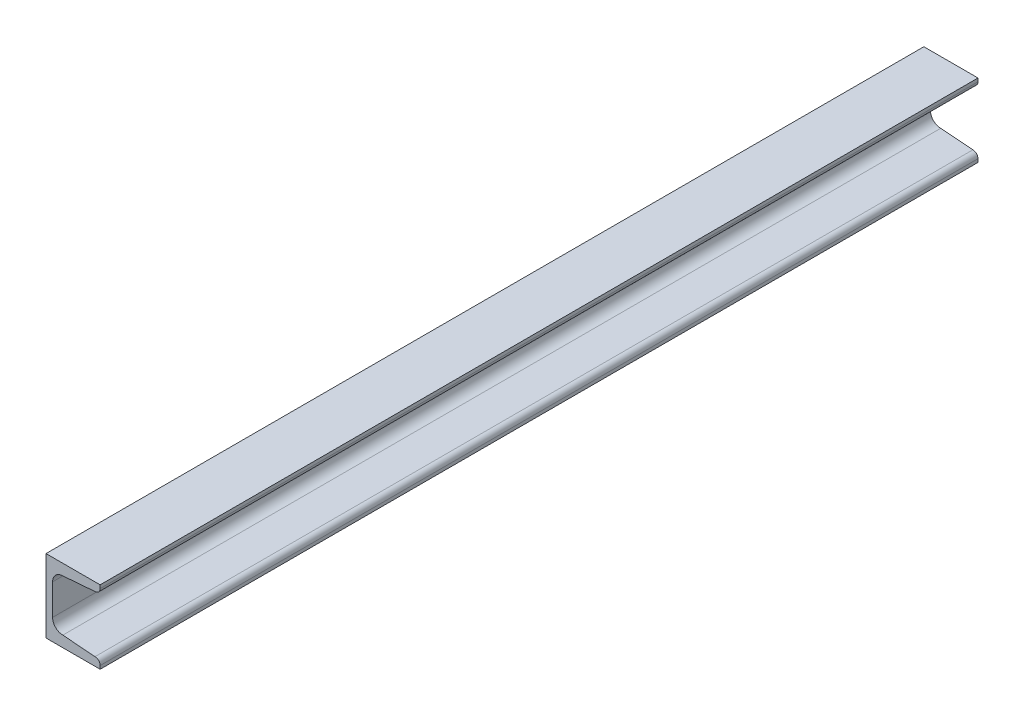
ISO-10303-21;
HEADER;
FILE_DESCRIPTION(('STEP AP214'),'2;1');
FILE_NAME('part.step','',(''),(''),'','','');
FILE_SCHEMA(('AUTOMOTIVE_DESIGN { 1 0 10303 214 1 1 1 1 }'));
ENDSEC;
DATA;
#1=APPLICATION_CONTEXT('core data for automotive mechanical design processes');
#2=APPLICATION_PROTOCOL_DEFINITION('international standard','automotive_design',2000,#1);
#3=PRODUCT_CONTEXT('',#1,'mechanical');
#4=PRODUCT('Part','Part','',(#3));
#5=PRODUCT_RELATED_PRODUCT_CATEGORY('part','',(#4));
#6=PRODUCT_DEFINITION_FORMATION('','',#4);
#7=PRODUCT_DEFINITION_CONTEXT('part definition',#1,'design');
#8=PRODUCT_DEFINITION('design','',#6,#7);
#9=PRODUCT_DEFINITION_SHAPE('','',#8);
#10=(LENGTH_UNIT() NAMED_UNIT(*) SI_UNIT(.MILLI.,.METRE.));
#11=(NAMED_UNIT(*) PLANE_ANGLE_UNIT() SI_UNIT($,.RADIAN.));
#12=(NAMED_UNIT(*) SI_UNIT($,.STERADIAN.) SOLID_ANGLE_UNIT());
#13=UNCERTAINTY_MEASURE_WITH_UNIT(LENGTH_MEASURE(1.E-05),#10,'distance_accuracy_value','');
#14=(GEOMETRIC_REPRESENTATION_CONTEXT(3) GLOBAL_UNCERTAINTY_ASSIGNED_CONTEXT((#13)) GLOBAL_UNIT_ASSIGNED_CONTEXT((#10,
#11,#12)) REPRESENTATION_CONTEXT('',''));
#15=CARTESIAN_POINT('',(0.,0.,0.));
#16=DIRECTION('',(0.,0.,1.));
#17=DIRECTION('',(1.,0.,0.));
#18=AXIS2_PLACEMENT_3D('',#15,#16,#17);
#19=CARTESIAN_POINT('',(4.5,-23.5226677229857,600.));
#20=DIRECTION('',(1.,0.,0.));
#21=DIRECTION('',(0.,0.,-1.));
#22=AXIS2_PLACEMENT_3D('',#19,#20,#21);
#23=PLANE('',#22);
#24=DIRECTION('',(0.,-1.,0.));
#25=VECTOR('',#24,1.);
#26=CARTESIAN_POINT('',(4.5,-23.5226677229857,0.));
#27=LINE('',#26,#25);
#28=CARTESIAN_POINT('',(4.5,35.525,0.));
#29=VERTEX_POINT('',#28);
#30=CARTESIAN_POINT('',(4.5,14.475,0.));
#31=VERTEX_POINT('',#30);
#32=EDGE_CURVE('E152',#29,#31,#27,.T.);
#33=ORIENTED_EDGE('',*,*,#32,.F.);
#34=DIRECTION('',(0.,0.,-1.));
#35=VECTOR('',#34,1.);
#36=CARTESIAN_POINT('',(4.5,35.525,600.));
#37=LINE('',#36,#35);
#38=CARTESIAN_POINT('',(4.5,35.525,600.));
#39=VERTEX_POINT('',#38);
#40=EDGE_CURVE('E11',#39,#29,#37,.T.);
#41=ORIENTED_EDGE('',*,*,#40,.F.);
#42=DIRECTION('',(0.,-1.,0.));
#43=VECTOR('',#42,1.);
#44=CARTESIAN_POINT('',(4.5,-23.5226677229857,600.));
#45=LINE('',#44,#43);
#46=CARTESIAN_POINT('',(4.5,14.475,600.));
#47=VERTEX_POINT('',#46);
#48=EDGE_CURVE('E181',#39,#47,#45,.T.);
#49=ORIENTED_EDGE('',*,*,#48,.T.);
#50=DIRECTION('',(0.,0.,-1.));
#51=VECTOR('',#50,1.);
#52=CARTESIAN_POINT('',(4.5,14.475,600.));
#53=LINE('',#52,#51);
#54=EDGE_CURVE('E50',#47,#31,#53,.T.);
#55=ORIENTED_EDGE('',*,*,#54,.T.);
#56=EDGE_LOOP('',(#33,#41,#49,#55));
#57=FACE_BOUND('',#56,.T.);
#58=ADVANCED_FACE('F34',(#57),#23,.T.);
#59=CARTESIAN_POINT('',(11.5,35.525,600.));
#60=DIRECTION('',(0.,0.,-1.));
#61=DIRECTION('',(-1.,0.,0.));
#62=AXIS2_PLACEMENT_3D('',#59,#60,#61);
#63=CYLINDRICAL_SURFACE('',#62,7.);
#64=CARTESIAN_POINT('',(11.5,35.525,0.));
#65=DIRECTION('',(0.,0.,1.));
#66=DIRECTION('',(1.,0.,0.));
#67=AXIS2_PLACEMENT_3D('',#64,#65,#66);
#68=CIRCLE('',#67,7.);
#69=CARTESIAN_POINT('',(11.5,42.525,0.));
#70=VERTEX_POINT('',#69);
#71=EDGE_CURVE('E154',#29,#70,#68,.F.);
#72=ORIENTED_EDGE('',*,*,#71,.T.);
#73=DIRECTION('',(0.,0.,-1.));
#74=VECTOR('',#73,1.);
#75=CARTESIAN_POINT('',(11.5,42.525,600.));
#76=LINE('',#75,#74);
#77=CARTESIAN_POINT('',(11.5,42.525,600.));
#78=VERTEX_POINT('',#77);
#79=EDGE_CURVE('E42',#78,#70,#76,.T.);
#80=ORIENTED_EDGE('',*,*,#79,.F.);
#81=CARTESIAN_POINT('',(11.5,35.525,600.));
#82=DIRECTION('',(0.,0.,1.));
#83=DIRECTION('',(1.,0.,0.));
#84=AXIS2_PLACEMENT_3D('',#81,#82,#83);
#85=CIRCLE('',#84,7.);
#86=EDGE_CURVE('E222',#39,#78,#85,.F.);
#87=ORIENTED_EDGE('',*,*,#86,.F.);
#88=ORIENTED_EDGE('',*,*,#40,.T.);
#89=EDGE_LOOP('',(#72,#80,#87,#88));
#90=FACE_BOUND('',#89,.T.);
#91=ADVANCED_FACE('F253',(#90),#63,.F.);
#92=CARTESIAN_POINT('',(13.2352286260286,42.6630295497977,600.));
#93=DIRECTION('',(-0.0792949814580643,0.996851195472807,0.));
#94=DIRECTION('',(-0.996851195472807,-0.0792949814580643,0.));
#95=AXIS2_PLACEMENT_3D('',#92,#93,#94);
#96=PLANE('',#95);
#97=DIRECTION('',(0.996851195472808,0.0792949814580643,0.));
#98=VECTOR('',#97,1.);
#99=CARTESIAN_POINT('',(13.2352286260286,42.6630295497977,0.));
#100=LINE('',#99,#98);
#101=CARTESIAN_POINT('',(33.5,44.275,0.));
#102=VERTEX_POINT('',#101);
#103=EDGE_CURVE('E156',#70,#102,#100,.T.);
#104=ORIENTED_EDGE('',*,*,#103,.T.);
#105=DIRECTION('',(0.,0.,-1.));
#106=VECTOR('',#105,1.);
#107=CARTESIAN_POINT('',(33.5,44.275,600.));
#108=LINE('',#107,#106);
#109=CARTESIAN_POINT('',(33.5,44.275,600.));
#110=VERTEX_POINT('',#109);
#111=EDGE_CURVE('E196',#110,#102,#108,.T.);
#112=ORIENTED_EDGE('',*,*,#111,.F.);
#113=DIRECTION('',(0.996851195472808,0.0792949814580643,0.));
#114=VECTOR('',#113,1.);
#115=CARTESIAN_POINT('',(13.2352286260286,42.6630295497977,600.));
#116=LINE('',#115,#114);
#117=EDGE_CURVE('E204',#78,#110,#116,.T.);
#118=ORIENTED_EDGE('',*,*,#117,.F.);
#119=ORIENTED_EDGE('',*,*,#79,.T.);
#120=EDGE_LOOP('',(#104,#112,#118,#119));
#121=FACE_BOUND('',#120,.T.);
#122=ADVANCED_FACE('F202',(#121),#96,.F.);
#123=CARTESIAN_POINT('',(33.5,47.775,600.));
#124=DIRECTION('',(0.,0.,-1.));
#125=DIRECTION('',(-1.,0.,0.));
#126=AXIS2_PLACEMENT_3D('',#123,#124,#125);
#127=CYLINDRICAL_SURFACE('',#126,3.5);
#128=CARTESIAN_POINT('',(33.5,47.775,0.));
#129=DIRECTION('',(0.,0.,1.));
#130=DIRECTION('',(1.,0.,0.));
#131=AXIS2_PLACEMENT_3D('',#128,#129,#130);
#132=CIRCLE('',#131,3.5);
#133=CARTESIAN_POINT('',(37.,47.775,0.));
#134=VERTEX_POINT('',#133);
#135=EDGE_CURVE('E159',#134,#102,#132,.F.);
#136=ORIENTED_EDGE('',*,*,#135,.F.);
#137=DIRECTION('',(0.,0.,-1.));
#138=VECTOR('',#137,1.);
#139=CARTESIAN_POINT('',(37.,47.775,600.));
#140=LINE('',#139,#138);
#141=CARTESIAN_POINT('',(37.,47.775,600.));
#142=VERTEX_POINT('',#141);
#143=EDGE_CURVE('E194',#142,#134,#140,.T.);
#144=ORIENTED_EDGE('',*,*,#143,.F.);
#145=CARTESIAN_POINT('',(33.5,47.775,600.));
#146=DIRECTION('',(0.,0.,1.));
#147=DIRECTION('',(1.,0.,0.));
#148=AXIS2_PLACEMENT_3D('',#145,#146,#147);
#149=CIRCLE('',#148,3.5);
#150=EDGE_CURVE('E215',#142,#110,#149,.F.);
#151=ORIENTED_EDGE('',*,*,#150,.T.);
#152=ORIENTED_EDGE('',*,*,#111,.T.);
#153=EDGE_LOOP('',(#136,#144,#151,#152));
#154=FACE_BOUND('',#153,.T.);
#155=ADVANCED_FACE('F212',(#154),#127,.T.);
#156=CARTESIAN_POINT('',(37.,-23.5226677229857,600.));
#157=DIRECTION('',(1.,0.,0.));
#158=DIRECTION('',(0.,0.,-1.));
#159=AXIS2_PLACEMENT_3D('',#156,#157,#158);
#160=PLANE('',#159);
#161=DIRECTION('',(0.,-1.,0.));
#162=VECTOR('',#161,1.);
#163=CARTESIAN_POINT('',(37.,-23.5226677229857,0.));
#164=LINE('',#163,#162);
#165=CARTESIAN_POINT('',(37.,50.,0.));
#166=VERTEX_POINT('',#165);
#167=EDGE_CURVE('E162',#166,#134,#164,.T.);
#168=ORIENTED_EDGE('',*,*,#167,.F.);
#169=DIRECTION('',(0.,0.,-1.));
#170=VECTOR('',#169,1.);
#171=CARTESIAN_POINT('',(37.,50.,600.));
#172=LINE('',#171,#170);
#173=CARTESIAN_POINT('',(37.,50.,600.));
#174=VERTEX_POINT('',#173);
#175=EDGE_CURVE('E192',#174,#166,#172,.T.);
#176=ORIENTED_EDGE('',*,*,#175,.F.);
#177=DIRECTION('',(0.,-1.,0.));
#178=VECTOR('',#177,1.);
#179=CARTESIAN_POINT('',(37.,-23.5226677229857,600.));
#180=LINE('',#179,#178);
#181=EDGE_CURVE('E218',#174,#142,#180,.T.);
#182=ORIENTED_EDGE('',*,*,#181,.T.);
#183=ORIENTED_EDGE('',*,*,#143,.T.);
#184=EDGE_LOOP('',(#168,#176,#182,#183));
#185=FACE_BOUND('',#184,.T.);
#186=ADVANCED_FACE('F264',(#185),#160,.T.);
#187=CARTESIAN_POINT('',(18.5,50.,600.));
#188=DIRECTION('',(0.,1.,0.));
#189=DIRECTION('',(0.,0.,1.));
#190=AXIS2_PLACEMENT_3D('',#187,#188,#189);
#191=PLANE('',#190);
#192=DIRECTION('',(1.,0.,0.));
#193=VECTOR('',#192,1.);
#194=CARTESIAN_POINT('',(18.5,50.,0.));
#195=LINE('',#194,#193);
#196=CARTESIAN_POINT('',(0.,50.,0.));
#197=VERTEX_POINT('',#196);
#198=EDGE_CURVE('E165',#197,#166,#195,.T.);
#199=ORIENTED_EDGE('',*,*,#198,.F.);
#200=DIRECTION('',(0.,0.,-1.));
#201=VECTOR('',#200,1.);
#202=CARTESIAN_POINT('',(0.,50.,600.));
#203=LINE('',#202,#201);
#204=CARTESIAN_POINT('',(0.,50.,600.));
#205=VERTEX_POINT('',#204);
#206=EDGE_CURVE('E190',#205,#197,#203,.T.);
#207=ORIENTED_EDGE('',*,*,#206,.F.);
#208=DIRECTION('',(1.,0.,0.));
#209=VECTOR('',#208,1.);
#210=CARTESIAN_POINT('',(18.5,50.,600.));
#211=LINE('',#210,#209);
#212=EDGE_CURVE('E220',#205,#174,#211,.T.);
#213=ORIENTED_EDGE('',*,*,#212,.T.);
#214=ORIENTED_EDGE('',*,*,#175,.T.);
#215=EDGE_LOOP('',(#199,#207,#213,#214));
#216=FACE_BOUND('',#215,.T.);
#217=ADVANCED_FACE('F267',(#216),#191,.T.);
#218=CARTESIAN_POINT('',(0.,-23.5226677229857,600.));
#219=DIRECTION('',(-1.,0.,0.));
#220=DIRECTION('',(0.,0.,1.));
#221=AXIS2_PLACEMENT_3D('',#218,#219,#220);
#222=PLANE('',#221);
#223=DIRECTION('',(0.,1.,0.));
#224=VECTOR('',#223,1.);
#225=CARTESIAN_POINT('',(0.,-23.5226677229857,0.));
#226=LINE('',#225,#224);
#227=CARTESIAN_POINT('',(0.,0.,0.));
#228=VERTEX_POINT('',#227);
#229=EDGE_CURVE('E168',#228,#197,#226,.T.);
#230=ORIENTED_EDGE('',*,*,#229,.F.);
#231=DIRECTION('',(0.,0.,-1.));
#232=VECTOR('',#231,1.);
#233=CARTESIAN_POINT('',(0.,0.,600.));
#234=LINE('',#233,#232);
#235=CARTESIAN_POINT('',(0.,0.,600.));
#236=VERTEX_POINT('',#235);
#237=EDGE_CURVE('E188',#236,#228,#234,.T.);
#238=ORIENTED_EDGE('',*,*,#237,.F.);
#239=DIRECTION('',(0.,1.,0.));
#240=VECTOR('',#239,1.);
#241=CARTESIAN_POINT('',(0.,-23.5226677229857,600.));
#242=LINE('',#241,#240);
#243=EDGE_CURVE('E228',#236,#205,#242,.T.);
#244=ORIENTED_EDGE('',*,*,#243,.T.);
#245=ORIENTED_EDGE('',*,*,#206,.T.);
#246=EDGE_LOOP('',(#230,#238,#244,#245));
#247=FACE_BOUND('',#246,.T.);
#248=ADVANCED_FACE('F271',(#247),#222,.T.);
#249=CARTESIAN_POINT('',(18.5,0.,600.));
#250=DIRECTION('',(0.,1.,0.));
#251=DIRECTION('',(0.,0.,1.));
#252=AXIS2_PLACEMENT_3D('',#249,#250,#251);
#253=PLANE('',#252);
#254=DIRECTION('',(1.,0.,0.));
#255=VECTOR('',#254,1.);
#256=CARTESIAN_POINT('',(18.5,0.,0.));
#257=LINE('',#256,#255);
#258=CARTESIAN_POINT('',(37.,0.,0.));
#259=VERTEX_POINT('',#258);
#260=EDGE_CURVE('E171',#228,#259,#257,.T.);
#261=ORIENTED_EDGE('',*,*,#260,.T.);
#262=DIRECTION('',(0.,0.,-1.));
#263=VECTOR('',#262,1.);
#264=CARTESIAN_POINT('',(37.,0.,600.));
#265=LINE('',#264,#263);
#266=CARTESIAN_POINT('',(37.,0.,600.));
#267=VERTEX_POINT('',#266);
#268=EDGE_CURVE('E185',#267,#259,#265,.T.);
#269=ORIENTED_EDGE('',*,*,#268,.F.);
#270=DIRECTION('',(1.,0.,0.));
#271=VECTOR('',#270,1.);
#272=CARTESIAN_POINT('',(18.5,0.,600.));
#273=LINE('',#272,#271);
#274=EDGE_CURVE('E231',#236,#267,#273,.T.);
#275=ORIENTED_EDGE('',*,*,#274,.F.);
#276=ORIENTED_EDGE('',*,*,#237,.T.);
#277=EDGE_LOOP('',(#261,#269,#275,#276));
#278=FACE_BOUND('',#277,.T.);
#279=ADVANCED_FACE('F237',(#278),#253,.F.);
#280=CARTESIAN_POINT('',(37.,-23.5226677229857,600.));
#281=DIRECTION('',(-1.,0.,0.));
#282=DIRECTION('',(0.,0.,1.));
#283=AXIS2_PLACEMENT_3D('',#280,#281,#282);
#284=PLANE('',#283);
#285=DIRECTION('',(0.,1.,0.));
#286=VECTOR('',#285,1.);
#287=CARTESIAN_POINT('',(37.,-23.5226677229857,0.));
#288=LINE('',#287,#286);
#289=CARTESIAN_POINT('',(37.,2.225,0.));
#290=VERTEX_POINT('',#289);
#291=EDGE_CURVE('E173',#259,#290,#288,.T.);
#292=ORIENTED_EDGE('',*,*,#291,.T.);
#293=DIRECTION('',(0.,0.,-1.));
#294=VECTOR('',#293,1.);
#295=CARTESIAN_POINT('',(37.,2.225,600.));
#296=LINE('',#295,#294);
#297=CARTESIAN_POINT('',(37.,2.225,600.));
#298=VERTEX_POINT('',#297);
#299=EDGE_CURVE('E144',#298,#290,#296,.T.);
#300=ORIENTED_EDGE('',*,*,#299,.F.);
#301=DIRECTION('',(0.,1.,0.));
#302=VECTOR('',#301,1.);
#303=CARTESIAN_POINT('',(37.,-23.5226677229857,600.));
#304=LINE('',#303,#302);
#305=EDGE_CURVE('E132',#267,#298,#304,.T.);
#306=ORIENTED_EDGE('',*,*,#305,.F.);
#307=ORIENTED_EDGE('',*,*,#268,.T.);
#308=EDGE_LOOP('',(#292,#300,#306,#307));
#309=FACE_BOUND('',#308,.T.);
#310=ADVANCED_FACE('F241',(#309),#284,.F.);
#311=CARTESIAN_POINT('',(33.5,2.225,600.));
#312=DIRECTION('',(0.,0.,-1.));
#313=DIRECTION('',(-1.,0.,0.));
#314=AXIS2_PLACEMENT_3D('',#311,#312,#313);
#315=CYLINDRICAL_SURFACE('',#314,3.5);
#316=CARTESIAN_POINT('',(33.5,2.225,0.));
#317=DIRECTION('',(0.,0.,1.));
#318=DIRECTION('',(1.,0.,0.));
#319=AXIS2_PLACEMENT_3D('',#316,#317,#318);
#320=CIRCLE('',#319,3.5);
#321=CARTESIAN_POINT('',(33.5,5.725,0.));
#322=VERTEX_POINT('',#321);
#323=EDGE_CURVE('E141',#290,#322,#320,.T.);
#324=ORIENTED_EDGE('',*,*,#323,.T.);
#325=DIRECTION('',(0.,0.,-1.));
#326=VECTOR('',#325,1.);
#327=CARTESIAN_POINT('',(33.5,5.725,600.));
#328=LINE('',#327,#326);
#329=CARTESIAN_POINT('',(33.5,5.725,600.));
#330=VERTEX_POINT('',#329);
#331=EDGE_CURVE('E138',#330,#322,#328,.T.);
#332=ORIENTED_EDGE('',*,*,#331,.F.);
#333=CARTESIAN_POINT('',(33.5,2.225,600.));
#334=DIRECTION('',(0.,0.,1.));
#335=DIRECTION('',(1.,0.,0.));
#336=AXIS2_PLACEMENT_3D('',#333,#334,#335);
#337=CIRCLE('',#336,3.5);
#338=EDGE_CURVE('E124',#298,#330,#337,.T.);
#339=ORIENTED_EDGE('',*,*,#338,.F.);
#340=ORIENTED_EDGE('',*,*,#299,.T.);
#341=EDGE_LOOP('',(#324,#332,#339,#340));
#342=FACE_BOUND('',#341,.T.);
#343=ADVANCED_FACE('F139',(#342),#315,.T.);
#344=CARTESIAN_POINT('',(20.906205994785,6.72677906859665,600.));
#345=DIRECTION('',(0.0792949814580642,0.996851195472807,0.));
#346=DIRECTION('',(-0.996851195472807,0.0792949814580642,0.));
#347=AXIS2_PLACEMENT_3D('',#344,#345,#346);
#348=PLANE('',#347);
#349=DIRECTION('',(0.996851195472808,-0.0792949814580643,0.));
#350=VECTOR('',#349,1.);
#351=CARTESIAN_POINT('',(20.906205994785,6.72677906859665,0.));
#352=LINE('',#351,#350);
#353=CARTESIAN_POINT('',(11.5,7.475,0.));
#354=VERTEX_POINT('',#353);
#355=EDGE_CURVE('E176',#354,#322,#352,.T.);
#356=ORIENTED_EDGE('',*,*,#355,.F.);
#357=DIRECTION('',(0.,0.,-1.));
#358=VECTOR('',#357,1.);
#359=CARTESIAN_POINT('',(11.5,7.475,600.));
#360=LINE('',#359,#358);
#361=CARTESIAN_POINT('',(11.5,7.475,600.));
#362=VERTEX_POINT('',#361);
#363=EDGE_CURVE('E87',#362,#354,#360,.T.);
#364=ORIENTED_EDGE('',*,*,#363,.F.);
#365=DIRECTION('',(0.996851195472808,-0.0792949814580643,0.));
#366=VECTOR('',#365,1.);
#367=CARTESIAN_POINT('',(20.906205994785,6.72677906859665,600.));
#368=LINE('',#367,#366);
#369=EDGE_CURVE('E130',#362,#330,#368,.T.);
#370=ORIENTED_EDGE('',*,*,#369,.T.);
#371=ORIENTED_EDGE('',*,*,#331,.T.);
#372=EDGE_LOOP('',(#356,#364,#370,#371));
#373=FACE_BOUND('',#372,.T.);
#374=ADVANCED_FACE('F146',(#373),#348,.T.);
#375=CARTESIAN_POINT('',(11.5,14.475,600.));
#376=DIRECTION('',(0.,0.,-1.));
#377=DIRECTION('',(-1.,0.,0.));
#378=AXIS2_PLACEMENT_3D('',#375,#376,#377);
#379=CYLINDRICAL_SURFACE('',#378,7.);
#380=CARTESIAN_POINT('',(11.5,14.475,0.));
#381=DIRECTION('',(0.,0.,1.));
#382=DIRECTION('',(1.,0.,0.));
#383=AXIS2_PLACEMENT_3D('',#380,#381,#382);
#384=CIRCLE('',#383,7.);
#385=EDGE_CURVE('E178',#31,#354,#384,.T.);
#386=ORIENTED_EDGE('',*,*,#385,.F.);
#387=ORIENTED_EDGE('',*,*,#54,.F.);
#388=CARTESIAN_POINT('',(11.5,14.475,600.));
#389=DIRECTION('',(0.,0.,1.));
#390=DIRECTION('',(1.,0.,0.));
#391=AXIS2_PLACEMENT_3D('',#388,#389,#390);
#392=CIRCLE('',#391,7.);
#393=EDGE_CURVE('E147',#47,#362,#392,.T.);
#394=ORIENTED_EDGE('',*,*,#393,.T.);
#395=ORIENTED_EDGE('',*,*,#363,.T.);
#396=EDGE_LOOP('',(#386,#387,#394,#395));
#397=FACE_BOUND('',#396,.T.);
#398=ADVANCED_FACE('F242',(#397),#379,.F.);
#399=CARTESIAN_POINT('',(18.5,-23.5226677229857,600.));
#400=DIRECTION('',(0.,0.,1.));
#401=DIRECTION('',(1.,0.,0.));
#402=AXIS2_PLACEMENT_3D('',#399,#400,#401);
#403=PLANE('',#402);
#404=ORIENTED_EDGE('',*,*,#48,.F.);
#405=ORIENTED_EDGE('',*,*,#86,.T.);
#406=ORIENTED_EDGE('',*,*,#117,.T.);
#407=ORIENTED_EDGE('',*,*,#150,.F.);
#408=ORIENTED_EDGE('',*,*,#181,.F.);
#409=ORIENTED_EDGE('',*,*,#212,.F.);
#410=ORIENTED_EDGE('',*,*,#243,.F.);
#411=ORIENTED_EDGE('',*,*,#274,.T.);
#412=ORIENTED_EDGE('',*,*,#305,.T.);
#413=ORIENTED_EDGE('',*,*,#338,.T.);
#414=ORIENTED_EDGE('',*,*,#369,.F.);
#415=ORIENTED_EDGE('',*,*,#393,.F.);
#416=EDGE_LOOP('',(#404,#405,#406,#407,#408,#409,#410,#411,#412,#413,#414,#415));
#417=FACE_BOUND('',#416,.T.);
#418=ADVANCED_FACE('F127',(#417),#403,.T.);
#419=CARTESIAN_POINT('',(18.5,-23.5226677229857,0.));
#420=DIRECTION('',(0.,0.,1.));
#421=DIRECTION('',(1.,0.,0.));
#422=AXIS2_PLACEMENT_3D('',#419,#420,#421);
#423=PLANE('',#422);
#424=ORIENTED_EDGE('',*,*,#32,.T.);
#425=ORIENTED_EDGE('',*,*,#385,.T.);
#426=ORIENTED_EDGE('',*,*,#355,.T.);
#427=ORIENTED_EDGE('',*,*,#323,.F.);
#428=ORIENTED_EDGE('',*,*,#291,.F.);
#429=ORIENTED_EDGE('',*,*,#260,.F.);
#430=ORIENTED_EDGE('',*,*,#229,.T.);
#431=ORIENTED_EDGE('',*,*,#198,.T.);
#432=ORIENTED_EDGE('',*,*,#167,.T.);
#433=ORIENTED_EDGE('',*,*,#135,.T.);
#434=ORIENTED_EDGE('',*,*,#103,.F.);
#435=ORIENTED_EDGE('',*,*,#71,.F.);
#436=EDGE_LOOP('',(#424,#425,#426,#427,#428,#429,#430,#431,#432,#433,#434,#435));
#437=FACE_BOUND('',#436,.T.);
#438=ADVANCED_FACE('F208',(#437),#423,.F.);
#439=CLOSED_SHELL('',(#58,#91,#122,#155,#186,#217,#248,#279,#310,#343,#374,#398,#418,#438));
#440=MANIFOLD_SOLID_BREP('B2',#439);
#441=ADVANCED_BREP_SHAPE_REPRESENTATION('',(#18,#440),#14);
#442=SHAPE_DEFINITION_REPRESENTATION(#9,#441);
ENDSEC;
END-ISO-10303-21;
